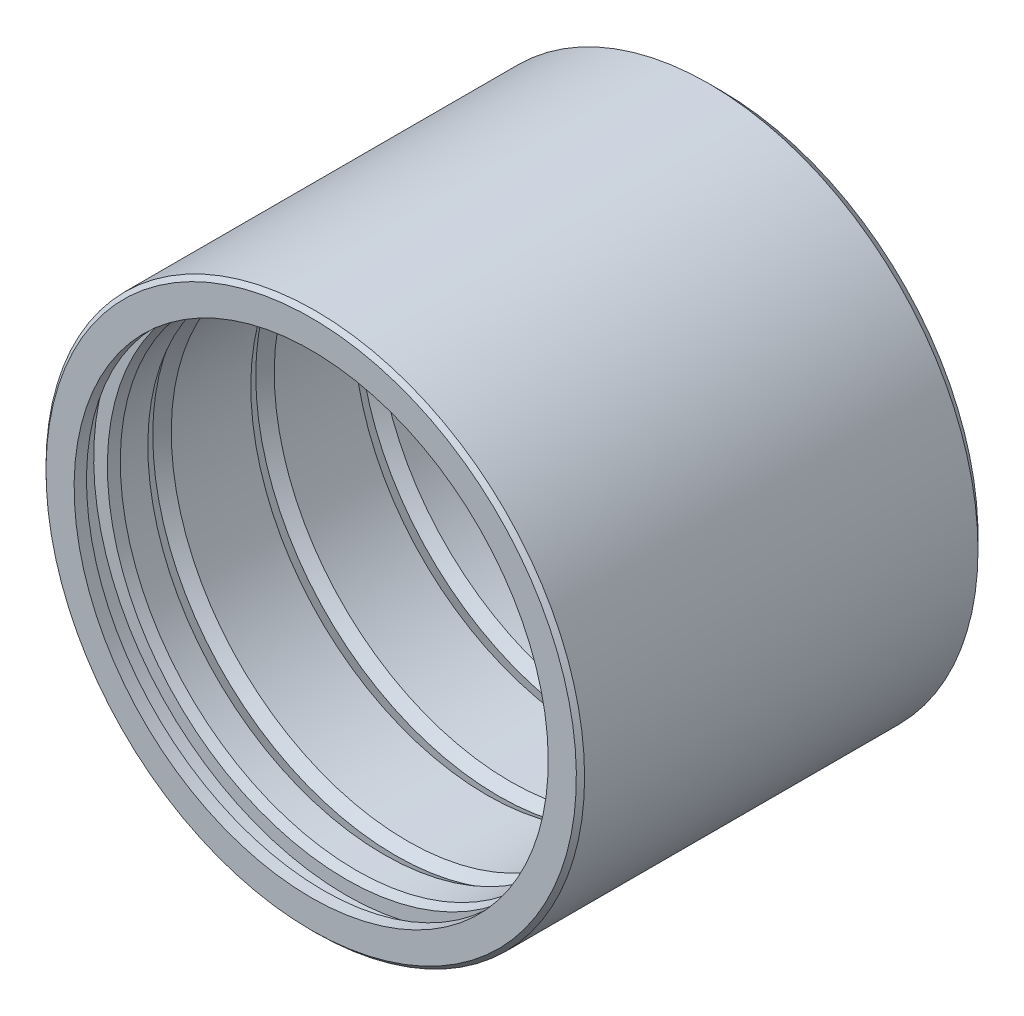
ISO-10303-21;
HEADER;
FILE_DESCRIPTION(('STEP AP214'),'2;1');
FILE_NAME('part.step','',(''),(''),'','','');
FILE_SCHEMA(('AUTOMOTIVE_DESIGN { 1 0 10303 214 1 1 1 1 }'));
ENDSEC;
DATA;
#1=APPLICATION_CONTEXT('core data for automotive mechanical design processes');
#2=APPLICATION_PROTOCOL_DEFINITION('international standard','automotive_design',2000,#1);
#3=PRODUCT_CONTEXT('',#1,'mechanical');
#4=PRODUCT('Part','Part','',(#3));
#5=PRODUCT_RELATED_PRODUCT_CATEGORY('part','',(#4));
#6=PRODUCT_DEFINITION_FORMATION('','',#4);
#7=PRODUCT_DEFINITION_CONTEXT('part definition',#1,'design');
#8=PRODUCT_DEFINITION('design','',#6,#7);
#9=PRODUCT_DEFINITION_SHAPE('','',#8);
#10=(LENGTH_UNIT() NAMED_UNIT(*) SI_UNIT(.MILLI.,.METRE.));
#11=(NAMED_UNIT(*) PLANE_ANGLE_UNIT() SI_UNIT($,.RADIAN.));
#12=(NAMED_UNIT(*) SI_UNIT($,.STERADIAN.) SOLID_ANGLE_UNIT());
#13=UNCERTAINTY_MEASURE_WITH_UNIT(LENGTH_MEASURE(1.E-05),#10,'distance_accuracy_value','');
#14=(GEOMETRIC_REPRESENTATION_CONTEXT(3) GLOBAL_UNCERTAINTY_ASSIGNED_CONTEXT((#13)) GLOBAL_UNIT_ASSIGNED_CONTEXT((#10,
#11,#12)) REPRESENTATION_CONTEXT('',''));
#15=CARTESIAN_POINT('',(0.,0.,0.));
#16=DIRECTION('',(0.,0.,1.));
#17=DIRECTION('',(1.,0.,0.));
#18=AXIS2_PLACEMENT_3D('',#15,#16,#17);
#19=CARTESIAN_POINT('',(0.,-128.75,97.5));
#20=DIRECTION('',(0.,0.,1.));
#21=DIRECTION('',(0.,-1.,0.));
#22=AXIS2_PLACEMENT_3D('',#19,#20,#21);
#23=PLANE('',#22);
#24=CARTESIAN_POINT('',(0.,0.,97.5));
#25=DIRECTION('',(0.,0.,1.));
#26=DIRECTION('',(0.,-1.,0.));
#27=AXIS2_PLACEMENT_3D('',#24,#25,#26);
#28=CIRCLE('',#27,128.75);
#29=CARTESIAN_POINT('',(0.,-128.75,97.5));
#30=VERTEX_POINT('',#29);
#31=EDGE_CURVE('E100',#30,#30,#28,.T.);
#32=ORIENTED_EDGE('',*,*,#31,.T.);
#33=EDGE_LOOP('',(#32));
#34=FACE_BOUND('',#33,.T.);
#35=CARTESIAN_POINT('',(0.,0.,97.5));
#36=DIRECTION('',(0.,0.,1.));
#37=DIRECTION('',(0.,-1.,0.));
#38=AXIS2_PLACEMENT_3D('',#35,#36,#37);
#39=CIRCLE('',#38,115.1);
#40=CARTESIAN_POINT('',(0.,-115.1,97.5));
#41=VERTEX_POINT('',#40);
#42=EDGE_CURVE('E10',#41,#41,#39,.T.);
#43=ORIENTED_EDGE('',*,*,#42,.F.);
#44=EDGE_LOOP('',(#43));
#45=FACE_BOUND('',#44,.T.);
#46=ADVANCED_FACE('F33',(#34,#45),#23,.T.);
#47=CARTESIAN_POINT('',(0.,0.,114.405553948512));
#48=DIRECTION('',(0.,0.,1.));
#49=DIRECTION('',(0.,-1.,0.));
#50=AXIS2_PLACEMENT_3D('',#47,#48,#49);
#51=CYLINDRICAL_SURFACE('',#50,115.1);
#52=ORIENTED_EDGE('',*,*,#42,.T.);
#53=EDGE_LOOP('',(#52));
#54=FACE_BOUND('',#53,.T.);
#55=CARTESIAN_POINT('',(0.,0.,91.5));
#56=DIRECTION('',(0.,0.,1.));
#57=DIRECTION('',(0.,-1.,0.));
#58=AXIS2_PLACEMENT_3D('',#55,#56,#57);
#59=CIRCLE('',#58,115.1);
#60=CARTESIAN_POINT('',(0.,-115.1,91.5));
#61=VERTEX_POINT('',#60);
#62=EDGE_CURVE('E39',#61,#61,#59,.T.);
#63=ORIENTED_EDGE('',*,*,#62,.F.);
#64=EDGE_LOOP('',(#63));
#65=FACE_BOUND('',#64,.T.);
#66=ADVANCED_FACE('F118',(#54,#65),#51,.F.);
#67=CARTESIAN_POINT('',(0.,-115.1,91.5));
#68=DIRECTION('',(0.,0.,-1.));
#69=DIRECTION('',(0.,1.,0.));
#70=AXIS2_PLACEMENT_3D('',#67,#68,#69);
#71=PLANE('',#70);
#72=ORIENTED_EDGE('',*,*,#62,.T.);
#73=EDGE_LOOP('',(#72));
#74=FACE_BOUND('',#73,.T.);
#75=CARTESIAN_POINT('',(0.,0.,91.5));
#76=DIRECTION('',(0.,0.,1.));
#77=DIRECTION('',(0.,-1.,0.));
#78=AXIS2_PLACEMENT_3D('',#75,#76,#77);
#79=CIRCLE('',#78,122.6);
#80=CARTESIAN_POINT('',(0.,-122.6,91.5));
#81=VERTEX_POINT('',#80);
#82=EDGE_CURVE('E43',#81,#81,#79,.T.);
#83=ORIENTED_EDGE('',*,*,#82,.F.);
#84=EDGE_LOOP('',(#83));
#85=FACE_BOUND('',#84,.T.);
#86=ADVANCED_FACE('F122',(#74,#85),#71,.T.);
#87=CARTESIAN_POINT('',(0.,0.,114.405553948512));
#88=DIRECTION('',(0.,0.,1.));
#89=DIRECTION('',(0.,-1.,0.));
#90=AXIS2_PLACEMENT_3D('',#87,#88,#89);
#91=CYLINDRICAL_SURFACE('',#90,122.6);
#92=ORIENTED_EDGE('',*,*,#82,.T.);
#93=EDGE_LOOP('',(#92));
#94=FACE_BOUND('',#93,.T.);
#95=CARTESIAN_POINT('',(0.,0.,80.5));
#96=DIRECTION('',(0.,0.,1.));
#97=DIRECTION('',(0.,-1.,0.));
#98=AXIS2_PLACEMENT_3D('',#95,#96,#97);
#99=CIRCLE('',#98,122.6);
#100=CARTESIAN_POINT('',(0.,-122.6,80.5));
#101=VERTEX_POINT('',#100);
#102=EDGE_CURVE('E47',#101,#101,#99,.T.);
#103=ORIENTED_EDGE('',*,*,#102,.F.);
#104=EDGE_LOOP('',(#103));
#105=FACE_BOUND('',#104,.T.);
#106=ADVANCED_FACE('F126',(#94,#105),#91,.F.);
#107=CARTESIAN_POINT('',(0.,-122.6,80.5));
#108=DIRECTION('',(0.,0.,1.));
#109=DIRECTION('',(0.,-1.,0.));
#110=AXIS2_PLACEMENT_3D('',#107,#108,#109);
#111=PLANE('',#110);
#112=ORIENTED_EDGE('',*,*,#102,.T.);
#113=EDGE_LOOP('',(#112));
#114=FACE_BOUND('',#113,.T.);
#115=CARTESIAN_POINT('',(0.,0.,80.5));
#116=DIRECTION('',(0.,0.,1.));
#117=DIRECTION('',(0.,-1.,0.));
#118=AXIS2_PLACEMENT_3D('',#115,#116,#117);
#119=CIRCLE('',#118,115.95);
#120=CARTESIAN_POINT('',(0.,-115.95,80.5));
#121=VERTEX_POINT('',#120);
#122=EDGE_CURVE('E52',#121,#121,#119,.T.);
#123=ORIENTED_EDGE('',*,*,#122,.F.);
#124=EDGE_LOOP('',(#123));
#125=FACE_BOUND('',#124,.T.);
#126=ADVANCED_FACE('F132',(#114,#125),#111,.T.);
#127=CARTESIAN_POINT('',(0.,0.,75.5550326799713));
#128=DIRECTION('',(0.,0.,1.));
#129=DIRECTION('',(0.,-1.,0.));
#130=AXIS2_PLACEMENT_3D('',#127,#128,#129);
#131=CONICAL_SURFACE('',#130,114.625,0.26179938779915);
#132=ORIENTED_EDGE('',*,*,#122,.T.);
#133=EDGE_LOOP('',(#132));
#134=FACE_BOUND('',#133,.T.);
#135=CARTESIAN_POINT('',(0.,0.,75.5550326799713));
#136=DIRECTION('',(0.,0.,1.));
#137=DIRECTION('',(0.,-1.,0.));
#138=AXIS2_PLACEMENT_3D('',#135,#136,#137);
#139=CIRCLE('',#138,114.625);
#140=CARTESIAN_POINT('',(0.,-114.625,75.5550326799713));
#141=VERTEX_POINT('',#140);
#142=EDGE_CURVE('E55',#141,#141,#139,.T.);
#143=ORIENTED_EDGE('',*,*,#142,.F.);
#144=EDGE_LOOP('',(#143));
#145=FACE_BOUND('',#144,.T.);
#146=ADVANCED_FACE('F136',(#134,#145),#131,.F.);
#147=CARTESIAN_POINT('',(0.,0.,114.405553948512));
#148=DIRECTION('',(0.,0.,1.));
#149=DIRECTION('',(0.,-1.,0.));
#150=AXIS2_PLACEMENT_3D('',#147,#148,#149);
#151=CYLINDRICAL_SURFACE('',#150,114.625);
#152=ORIENTED_EDGE('',*,*,#142,.T.);
#153=EDGE_LOOP('',(#152));
#154=FACE_BOUND('',#153,.T.);
#155=CARTESIAN_POINT('',(0.,0.,62.1897869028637));
#156=DIRECTION('',(0.,0.,1.));
#157=DIRECTION('',(0.,-1.,0.));
#158=AXIS2_PLACEMENT_3D('',#155,#156,#157);
#159=CIRCLE('',#158,114.625);
#160=CARTESIAN_POINT('',(0.,-114.625,62.1897869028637));
#161=VERTEX_POINT('',#160);
#162=EDGE_CURVE('E58',#161,#161,#159,.T.);
#163=ORIENTED_EDGE('',*,*,#162,.F.);
#164=EDGE_LOOP('',(#163));
#165=FACE_BOUND('',#164,.T.);
#166=ADVANCED_FACE('F140',(#154,#165),#151,.F.);
#167=CARTESIAN_POINT('',(0.,0.,56.5));
#168=DIRECTION('',(0.,0.,-1.));
#169=DIRECTION('',(0.,1.,0.));
#170=AXIS2_PLACEMENT_3D('',#167,#168,#169);
#171=CONICAL_SURFACE('',#170,117.91,0.5235987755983);
#172=ORIENTED_EDGE('',*,*,#162,.T.);
#173=EDGE_LOOP('',(#172));
#174=FACE_BOUND('',#173,.T.);
#175=CARTESIAN_POINT('',(0.,0.,56.5));
#176=DIRECTION('',(0.,0.,1.));
#177=DIRECTION('',(0.,-1.,0.));
#178=AXIS2_PLACEMENT_3D('',#175,#176,#177);
#179=CIRCLE('',#178,117.91);
#180=CARTESIAN_POINT('',(0.,-117.91,56.5));
#181=VERTEX_POINT('',#180);
#182=EDGE_CURVE('E61',#181,#181,#179,.T.);
#183=ORIENTED_EDGE('',*,*,#182,.F.);
#184=EDGE_LOOP('',(#183));
#185=FACE_BOUND('',#184,.T.);
#186=ADVANCED_FACE('F144',(#174,#185),#171,.F.);
#187=CARTESIAN_POINT('',(0.,0.,50.8102130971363));
#188=DIRECTION('',(0.,0.,1.));
#189=DIRECTION('',(0.,-1.,0.));
#190=AXIS2_PLACEMENT_3D('',#187,#188,#189);
#191=CONICAL_SURFACE('',#190,114.625,0.5235987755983);
#192=ORIENTED_EDGE('',*,*,#182,.T.);
#193=EDGE_LOOP('',(#192));
#194=FACE_BOUND('',#193,.T.);
#195=CARTESIAN_POINT('',(0.,0.,50.8102130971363));
#196=DIRECTION('',(0.,0.,1.));
#197=DIRECTION('',(0.,-1.,0.));
#198=AXIS2_PLACEMENT_3D('',#195,#196,#197);
#199=CIRCLE('',#198,114.625);
#200=CARTESIAN_POINT('',(0.,-114.625,50.8102130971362));
#201=VERTEX_POINT('',#200);
#202=EDGE_CURVE('E64',#201,#201,#199,.T.);
#203=ORIENTED_EDGE('',*,*,#202,.F.);
#204=EDGE_LOOP('',(#203));
#205=FACE_BOUND('',#204,.T.);
#206=ADVANCED_FACE('F148',(#194,#205),#191,.F.);
#207=CARTESIAN_POINT('',(0.,0.,114.405553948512));
#208=DIRECTION('',(0.,0.,1.));
#209=DIRECTION('',(0.,-1.,0.));
#210=AXIS2_PLACEMENT_3D('',#207,#208,#209);
#211=CYLINDRICAL_SURFACE('',#210,114.625);
#212=ORIENTED_EDGE('',*,*,#202,.T.);
#213=EDGE_LOOP('',(#212));
#214=FACE_BOUND('',#213,.T.);
#215=CARTESIAN_POINT('',(0.,0.,12.1897869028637));
#216=DIRECTION('',(0.,0.,1.));
#217=DIRECTION('',(0.,-1.,0.));
#218=AXIS2_PLACEMENT_3D('',#215,#216,#217);
#219=CIRCLE('',#218,114.625);
#220=CARTESIAN_POINT('',(0.,-114.625,12.1897869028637));
#221=VERTEX_POINT('',#220);
#222=EDGE_CURVE('E67',#221,#221,#219,.T.);
#223=ORIENTED_EDGE('',*,*,#222,.F.);
#224=EDGE_LOOP('',(#223));
#225=FACE_BOUND('',#224,.T.);
#226=ADVANCED_FACE('F152',(#214,#225),#211,.F.);
#227=CARTESIAN_POINT('',(0.,0.,6.50000000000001));
#228=DIRECTION('',(0.,0.,-1.));
#229=DIRECTION('',(0.,1.,0.));
#230=AXIS2_PLACEMENT_3D('',#227,#228,#229);
#231=CONICAL_SURFACE('',#230,117.91,0.523598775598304);
#232=ORIENTED_EDGE('',*,*,#222,.T.);
#233=EDGE_LOOP('',(#232));
#234=FACE_BOUND('',#233,.T.);
#235=CARTESIAN_POINT('',(0.,0.,6.50000000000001));
#236=DIRECTION('',(0.,0.,1.));
#237=DIRECTION('',(0.,-1.,0.));
#238=AXIS2_PLACEMENT_3D('',#235,#236,#237);
#239=CIRCLE('',#238,117.91);
#240=CARTESIAN_POINT('',(0.,-117.91,6.49999999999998));
#241=VERTEX_POINT('',#240);
#242=EDGE_CURVE('E70',#241,#241,#239,.T.);
#243=ORIENTED_EDGE('',*,*,#242,.F.);
#244=EDGE_LOOP('',(#243));
#245=FACE_BOUND('',#244,.T.);
#246=ADVANCED_FACE('F156',(#234,#245),#231,.F.);
#247=CARTESIAN_POINT('',(0.,0.,0.810213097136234));
#248=DIRECTION('',(0.,0.,1.));
#249=DIRECTION('',(0.,-1.,0.));
#250=AXIS2_PLACEMENT_3D('',#247,#248,#249);
#251=CONICAL_SURFACE('',#250,114.625,0.523598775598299);
#252=ORIENTED_EDGE('',*,*,#242,.T.);
#253=EDGE_LOOP('',(#252));
#254=FACE_BOUND('',#253,.T.);
#255=CARTESIAN_POINT('',(0.,0.,0.810213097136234));
#256=DIRECTION('',(0.,0.,1.));
#257=DIRECTION('',(0.,-1.,0.));
#258=AXIS2_PLACEMENT_3D('',#255,#256,#257);
#259=CIRCLE('',#258,114.625);
#260=CARTESIAN_POINT('',(0.,-114.625,0.810213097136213));
#261=VERTEX_POINT('',#260);
#262=EDGE_CURVE('E73',#261,#261,#259,.T.);
#263=ORIENTED_EDGE('',*,*,#262,.F.);
#264=EDGE_LOOP('',(#263));
#265=FACE_BOUND('',#264,.T.);
#266=ADVANCED_FACE('F160',(#254,#265),#251,.F.);
#267=CARTESIAN_POINT('',(0.,0.,114.405553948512));
#268=DIRECTION('',(0.,0.,1.));
#269=DIRECTION('',(0.,-1.,0.));
#270=AXIS2_PLACEMENT_3D('',#267,#268,#269);
#271=CYLINDRICAL_SURFACE('',#270,114.625);
#272=ORIENTED_EDGE('',*,*,#262,.T.);
#273=EDGE_LOOP('',(#272));
#274=FACE_BOUND('',#273,.T.);
#275=CARTESIAN_POINT('',(0.,0.,-37.8102130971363));
#276=DIRECTION('',(0.,0.,1.));
#277=DIRECTION('',(0.,-1.,0.));
#278=AXIS2_PLACEMENT_3D('',#275,#276,#277);
#279=CIRCLE('',#278,114.625);
#280=CARTESIAN_POINT('',(0.,-114.625,-37.8102130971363));
#281=VERTEX_POINT('',#280);
#282=EDGE_CURVE('E76',#281,#281,#279,.T.);
#283=ORIENTED_EDGE('',*,*,#282,.F.);
#284=EDGE_LOOP('',(#283));
#285=FACE_BOUND('',#284,.T.);
#286=ADVANCED_FACE('F164',(#274,#285),#271,.F.);
#287=CARTESIAN_POINT('',(0.,0.,-43.5));
#288=DIRECTION('',(0.,0.,-1.));
#289=DIRECTION('',(0.,1.,0.));
#290=AXIS2_PLACEMENT_3D('',#287,#288,#289);
#291=CONICAL_SURFACE('',#290,117.91,0.523598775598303);
#292=ORIENTED_EDGE('',*,*,#282,.T.);
#293=EDGE_LOOP('',(#292));
#294=FACE_BOUND('',#293,.T.);
#295=CARTESIAN_POINT('',(0.,0.,-43.5));
#296=DIRECTION('',(0.,0.,1.));
#297=DIRECTION('',(0.,-1.,0.));
#298=AXIS2_PLACEMENT_3D('',#295,#296,#297);
#299=CIRCLE('',#298,117.91);
#300=CARTESIAN_POINT('',(0.,-117.91,-43.5));
#301=VERTEX_POINT('',#300);
#302=EDGE_CURVE('E79',#301,#301,#299,.T.);
#303=ORIENTED_EDGE('',*,*,#302,.F.);
#304=EDGE_LOOP('',(#303));
#305=FACE_BOUND('',#304,.T.);
#306=ADVANCED_FACE('F168',(#294,#305),#291,.F.);
#307=CARTESIAN_POINT('',(0.,0.,-49.1897869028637));
#308=DIRECTION('',(0.,0.,1.));
#309=DIRECTION('',(0.,-1.,0.));
#310=AXIS2_PLACEMENT_3D('',#307,#308,#309);
#311=CONICAL_SURFACE('',#310,114.625,0.523598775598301);
#312=ORIENTED_EDGE('',*,*,#302,.T.);
#313=EDGE_LOOP('',(#312));
#314=FACE_BOUND('',#313,.T.);
#315=CARTESIAN_POINT('',(0.,0.,-49.1897869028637));
#316=DIRECTION('',(0.,0.,1.));
#317=DIRECTION('',(0.,-1.,0.));
#318=AXIS2_PLACEMENT_3D('',#315,#316,#317);
#319=CIRCLE('',#318,114.625);
#320=CARTESIAN_POINT('',(0.,-114.625,-49.1897869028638));
#321=VERTEX_POINT('',#320);
#322=EDGE_CURVE('E82',#321,#321,#319,.T.);
#323=ORIENTED_EDGE('',*,*,#322,.F.);
#324=EDGE_LOOP('',(#323));
#325=FACE_BOUND('',#324,.T.);
#326=ADVANCED_FACE('F172',(#314,#325),#311,.F.);
#327=CARTESIAN_POINT('',(0.,0.,114.405553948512));
#328=DIRECTION('',(0.,0.,1.));
#329=DIRECTION('',(0.,-1.,0.));
#330=AXIS2_PLACEMENT_3D('',#327,#328,#329);
#331=CYLINDRICAL_SURFACE('',#330,114.625);
#332=ORIENTED_EDGE('',*,*,#322,.T.);
#333=EDGE_LOOP('',(#332));
#334=FACE_BOUND('',#333,.T.);
#335=CARTESIAN_POINT('',(0.,0.,-93.009584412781));
#336=DIRECTION('',(0.,0.,1.));
#337=DIRECTION('',(0.,-1.,0.));
#338=AXIS2_PLACEMENT_3D('',#335,#336,#337);
#339=CIRCLE('',#338,114.625);
#340=CARTESIAN_POINT('',(0.,-114.625,-93.009584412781));
#341=VERTEX_POINT('',#340);
#342=EDGE_CURVE('E85',#341,#341,#339,.T.);
#343=ORIENTED_EDGE('',*,*,#342,.F.);
#344=EDGE_LOOP('',(#343));
#345=FACE_BOUND('',#344,.T.);
#346=ADVANCED_FACE('F176',(#334,#345),#331,.F.);
#347=CARTESIAN_POINT('',(0.,0.,-101.5));
#348=DIRECTION('',(0.,0.,-1.));
#349=DIRECTION('',(0.,1.,0.));
#350=AXIS2_PLACEMENT_3D('',#347,#348,#349);
#351=CONICAL_SURFACE('',#350,116.9,0.261799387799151);
#352=ORIENTED_EDGE('',*,*,#342,.T.);
#353=EDGE_LOOP('',(#352));
#354=FACE_BOUND('',#353,.T.);
#355=CARTESIAN_POINT('',(0.,0.,-101.5));
#356=DIRECTION('',(0.,0.,1.));
#357=DIRECTION('',(0.,-1.,0.));
#358=AXIS2_PLACEMENT_3D('',#355,#356,#357);
#359=CIRCLE('',#358,116.9);
#360=CARTESIAN_POINT('',(0.,-116.9,-101.5));
#361=VERTEX_POINT('',#360);
#362=EDGE_CURVE('E88',#361,#361,#359,.T.);
#363=ORIENTED_EDGE('',*,*,#362,.F.);
#364=EDGE_LOOP('',(#363));
#365=FACE_BOUND('',#364,.T.);
#366=ADVANCED_FACE('F180',(#354,#365),#351,.F.);
#367=CARTESIAN_POINT('',(0.,-116.9,-101.5));
#368=DIRECTION('',(0.,0.,-1.));
#369=DIRECTION('',(0.,1.,0.));
#370=AXIS2_PLACEMENT_3D('',#367,#368,#369);
#371=PLANE('',#370);
#372=ORIENTED_EDGE('',*,*,#362,.T.);
#373=EDGE_LOOP('',(#372));
#374=FACE_BOUND('',#373,.T.);
#375=CARTESIAN_POINT('',(0.,0.,-101.5));
#376=DIRECTION('',(0.,0.,1.));
#377=DIRECTION('',(0.,-1.,0.));
#378=AXIS2_PLACEMENT_3D('',#375,#376,#377);
#379=CIRCLE('',#378,124.75);
#380=CARTESIAN_POINT('',(0.,-124.75,-101.5));
#381=VERTEX_POINT('',#380);
#382=EDGE_CURVE('E91',#381,#381,#379,.T.);
#383=ORIENTED_EDGE('',*,*,#382,.F.);
#384=EDGE_LOOP('',(#383));
#385=FACE_BOUND('',#384,.T.);
#386=ADVANCED_FACE('F184',(#374,#385),#371,.T.);
#387=CARTESIAN_POINT('',(0.,0.,-95.5));
#388=DIRECTION('',(0.,0.,1.));
#389=DIRECTION('',(0.,-1.,0.));
#390=AXIS2_PLACEMENT_3D('',#387,#388,#389);
#391=CONICAL_SURFACE('',#390,130.75,0.785398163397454);
#392=ORIENTED_EDGE('',*,*,#382,.T.);
#393=EDGE_LOOP('',(#392));
#394=FACE_BOUND('',#393,.T.);
#395=CARTESIAN_POINT('',(0.,0.,-95.5));
#396=DIRECTION('',(0.,0.,1.));
#397=DIRECTION('',(0.,-1.,0.));
#398=AXIS2_PLACEMENT_3D('',#395,#396,#397);
#399=CIRCLE('',#398,130.75);
#400=CARTESIAN_POINT('',(0.,-130.75,-95.5));
#401=VERTEX_POINT('',#400);
#402=EDGE_CURVE('E94',#401,#401,#399,.T.);
#403=ORIENTED_EDGE('',*,*,#402,.F.);
#404=EDGE_LOOP('',(#403));
#405=FACE_BOUND('',#404,.T.);
#406=ADVANCED_FACE('F114',(#394,#405),#391,.T.);
#407=CARTESIAN_POINT('',(0.,0.,114.405553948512));
#408=DIRECTION('',(0.,0.,1.));
#409=DIRECTION('',(0.,-1.,0.));
#410=AXIS2_PLACEMENT_3D('',#407,#408,#409);
#411=CYLINDRICAL_SURFACE('',#410,130.75);
#412=ORIENTED_EDGE('',*,*,#402,.T.);
#413=EDGE_LOOP('',(#412));
#414=FACE_BOUND('',#413,.T.);
#415=CARTESIAN_POINT('',(0.,0.,95.5));
#416=DIRECTION('',(0.,0.,1.));
#417=DIRECTION('',(0.,-1.,0.));
#418=AXIS2_PLACEMENT_3D('',#415,#416,#417);
#419=CIRCLE('',#418,130.75);
#420=CARTESIAN_POINT('',(0.,-130.75,95.5));
#421=VERTEX_POINT('',#420);
#422=EDGE_CURVE('E97',#421,#421,#419,.T.);
#423=ORIENTED_EDGE('',*,*,#422,.F.);
#424=EDGE_LOOP('',(#423));
#425=FACE_BOUND('',#424,.T.);
#426=ADVANCED_FACE('F108',(#414,#425),#411,.T.);
#427=CARTESIAN_POINT('',(0.,0.,97.5));
#428=DIRECTION('',(0.,0.,-1.));
#429=DIRECTION('',(0.,1.,0.));
#430=AXIS2_PLACEMENT_3D('',#427,#428,#429);
#431=CONICAL_SURFACE('',#430,128.75,0.785398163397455);
#432=ORIENTED_EDGE('',*,*,#422,.T.);
#433=EDGE_LOOP('',(#432));
#434=FACE_BOUND('',#433,.T.);
#435=ORIENTED_EDGE('',*,*,#31,.F.);
#436=EDGE_LOOP('',(#435));
#437=FACE_BOUND('',#436,.T.);
#438=ADVANCED_FACE('F106',(#434,#437),#431,.T.);
#439=CLOSED_SHELL('',(#46,#66,#86,#106,#126,#146,#166,#186,#206,#226,#246,#266,#286,#306,#326,
#346,#366,#386,#406,#426,#438));
#440=MANIFOLD_SOLID_BREP('B2',#439);
#441=ADVANCED_BREP_SHAPE_REPRESENTATION('',(#18,#440),#14);
#442=SHAPE_DEFINITION_REPRESENTATION(#9,#441);
ENDSEC;
END-ISO-10303-21;
